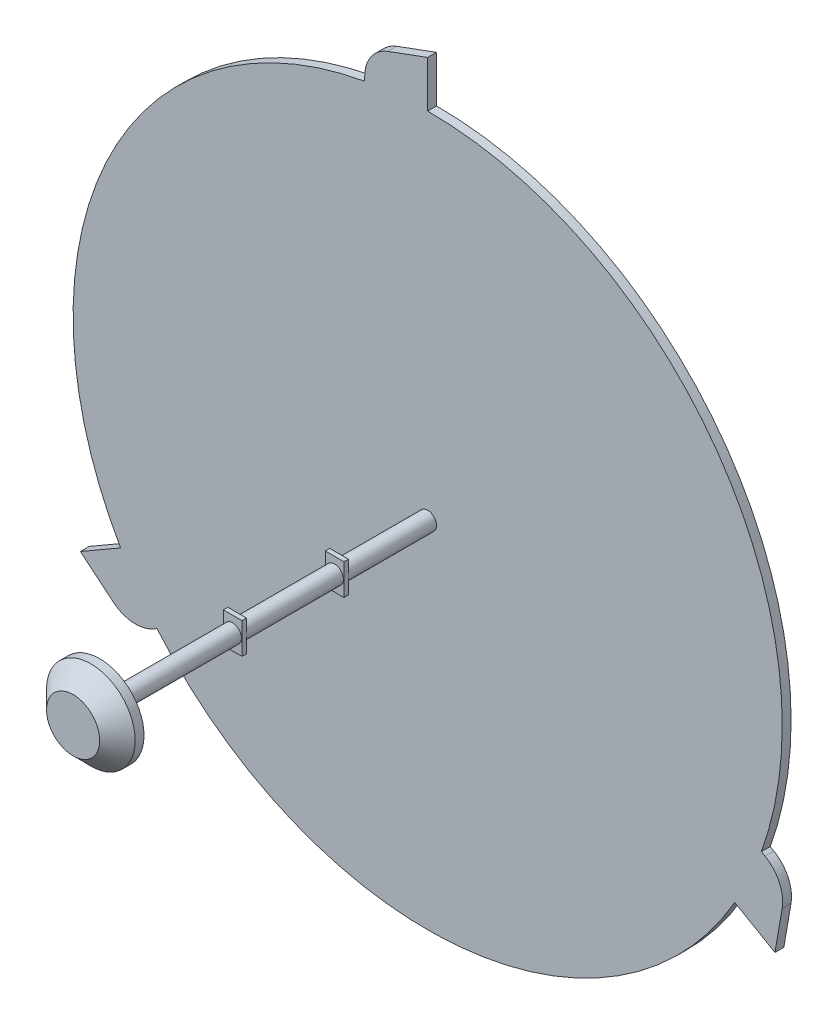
ISO-10303-21;
HEADER;
FILE_DESCRIPTION(('STEP AP214'),'2;1');
FILE_NAME('part.step','',(''),(''),'','','');
FILE_SCHEMA(('AUTOMOTIVE_DESIGN { 1 0 10303 214 1 1 1 1 }'));
ENDSEC;
DATA;
#1=APPLICATION_CONTEXT('core data for automotive mechanical design processes');
#2=APPLICATION_PROTOCOL_DEFINITION('international standard','automotive_design',2000,#1);
#3=PRODUCT_CONTEXT('',#1,'mechanical');
#4=PRODUCT('Part','Part','',(#3));
#5=PRODUCT_RELATED_PRODUCT_CATEGORY('part','',(#4));
#6=PRODUCT_DEFINITION_FORMATION('','',#4);
#7=PRODUCT_DEFINITION_CONTEXT('part definition',#1,'design');
#8=PRODUCT_DEFINITION('design','',#6,#7);
#9=PRODUCT_DEFINITION_SHAPE('','',#8);
#10=(LENGTH_UNIT() NAMED_UNIT(*) SI_UNIT(.MILLI.,.METRE.));
#11=(NAMED_UNIT(*) PLANE_ANGLE_UNIT() SI_UNIT($,.RADIAN.));
#12=(NAMED_UNIT(*) SI_UNIT($,.STERADIAN.) SOLID_ANGLE_UNIT());
#13=UNCERTAINTY_MEASURE_WITH_UNIT(LENGTH_MEASURE(1.E-05),#10,'distance_accuracy_value','');
#14=(GEOMETRIC_REPRESENTATION_CONTEXT(3) GLOBAL_UNCERTAINTY_ASSIGNED_CONTEXT((#13)) GLOBAL_UNIT_ASSIGNED_CONTEXT((#10,
#11,#12)) REPRESENTATION_CONTEXT('',''));
#15=CARTESIAN_POINT('',(0.,0.,0.));
#16=DIRECTION('',(0.,0.,1.));
#17=DIRECTION('',(1.,0.,0.));
#18=AXIS2_PLACEMENT_3D('',#15,#16,#17);
#19=CARTESIAN_POINT('',(0.,0.,-230.));
#20=DIRECTION('',(0.,0.,1.));
#21=DIRECTION('',(1.,0.,0.));
#22=AXIS2_PLACEMENT_3D('',#19,#20,#21);
#23=CYLINDRICAL_SURFACE('',#22,400.);
#24=CARTESIAN_POINT('',(0.,0.,-220.));
#25=DIRECTION('',(0.,0.,-1.));
#26=DIRECTION('',(-1.,0.,0.));
#27=AXIS2_PLACEMENT_3D('',#24,#25,#26);
#28=CIRCLE('',#27,400.);
#29=CARTESIAN_POINT('',(0.,400.,-220.));
#30=VERTEX_POINT('',#29);
#31=CARTESIAN_POINT('',(376.427028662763,-135.287442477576,-220.));
#32=VERTEX_POINT('',#31);
#33=EDGE_CURVE('E210',#30,#32,#28,.T.);
#34=ORIENTED_EDGE('',*,*,#33,.T.);
#35=DIRECTION('',(0.,0.,1.));
#36=VECTOR('',#35,1.);
#37=CARTESIAN_POINT('',(376.427028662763,-135.287442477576,-230.));
#38=LINE('',#37,#36);
#39=CARTESIAN_POINT('',(376.427028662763,-135.287442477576,-230.));
#40=VERTEX_POINT('',#39);
#41=EDGE_CURVE('E347',#40,#32,#38,.T.);
#42=ORIENTED_EDGE('',*,*,#41,.F.);
#43=CARTESIAN_POINT('',(0.,0.,-230.));
#44=DIRECTION('',(0.,0.,-1.));
#45=DIRECTION('',(-1.,0.,0.));
#46=AXIS2_PLACEMENT_3D('',#43,#44,#45);
#47=CIRCLE('',#46,400.);
#48=CARTESIAN_POINT('',(0.,400.,-230.));
#49=VERTEX_POINT('',#48);
#50=EDGE_CURVE('E220',#49,#40,#47,.T.);
#51=ORIENTED_EDGE('',*,*,#50,.F.);
#52=DIRECTION('',(0.,0.,1.));
#53=VECTOR('',#52,1.);
#54=CARTESIAN_POINT('',(0.,400.,-230.));
#55=LINE('',#54,#53);
#56=EDGE_CURVE('E218',#49,#30,#55,.T.);
#57=ORIENTED_EDGE('',*,*,#56,.T.);
#58=EDGE_LOOP('',(#34,#42,#51,#57));
#59=FACE_BOUND('',#58,.T.);
#60=ADVANCED_FACE('F32',(#59),#23,.T.);
#61=CARTESIAN_POINT('',(346.410161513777,-199.999999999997,-230.));
#62=VERTEX_POINT('',#61);
#63=CARTESIAN_POINT('',(-305.375876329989,-258.351648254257,-230.));
#64=VERTEX_POINT('',#63);
#65=EDGE_CURVE('E203',#62,#64,#47,.T.);
#66=ORIENTED_EDGE('',*,*,#65,.F.);
#67=DIRECTION('',(0.,0.,1.));
#68=VECTOR('',#67,1.);
#69=CARTESIAN_POINT('',(346.410161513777,-199.999999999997,-230.));
#70=LINE('',#69,#68);
#71=CARTESIAN_POINT('',(346.410161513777,-199.999999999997,-220.));
#72=VERTEX_POINT('',#71);
#73=EDGE_CURVE('E189',#62,#72,#70,.T.);
#74=ORIENTED_EDGE('',*,*,#73,.T.);
#75=CARTESIAN_POINT('',(-305.375876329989,-258.351648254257,-220.));
#76=VERTEX_POINT('',#75);
#77=EDGE_CURVE('E200',#72,#76,#28,.T.);
#78=ORIENTED_EDGE('',*,*,#77,.T.);
#79=DIRECTION('',(0.,0.,1.));
#80=VECTOR('',#79,1.);
#81=CARTESIAN_POINT('',(-305.375876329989,-258.351648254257,-230.));
#82=LINE('',#81,#80);
#83=EDGE_CURVE('E367',#64,#76,#82,.T.);
#84=ORIENTED_EDGE('',*,*,#83,.F.);
#85=EDGE_LOOP('',(#66,#74,#78,#84));
#86=FACE_BOUND('',#85,.T.);
#87=ADVANCED_FACE('F198',(#86),#23,.T.);
#88=CARTESIAN_POINT('',(10.5,17.5,-120.));
#89=DIRECTION('',(0.,0.,-1.));
#90=DIRECTION('',(-1.,0.,0.));
#91=AXIS2_PLACEMENT_3D('',#88,#89,#90);
#92=PLANE('',#91);
#93=DIRECTION('',(1.,0.,0.));
#94=VECTOR('',#93,1.);
#95=CARTESIAN_POINT('',(-10.5,17.5,-120.));
#96=LINE('',#95,#94);
#97=CARTESIAN_POINT('',(-10.5,17.5,-120.));
#98=VERTEX_POINT('',#97);
#99=CARTESIAN_POINT('',(10.5,17.5,-120.));
#100=VERTEX_POINT('',#99);
#101=EDGE_CURVE('E241',#98,#100,#96,.T.);
#102=ORIENTED_EDGE('',*,*,#101,.T.);
#103=DIRECTION('',(0.,-1.,0.));
#104=VECTOR('',#103,1.);
#105=CARTESIAN_POINT('',(10.5,17.5,-120.));
#106=LINE('',#105,#104);
#107=CARTESIAN_POINT('',(10.5,-17.5,-120.));
#108=VERTEX_POINT('',#107);
#109=EDGE_CURVE('E244',#100,#108,#106,.T.);
#110=ORIENTED_EDGE('',*,*,#109,.T.);
#111=DIRECTION('',(-1.,0.,0.));
#112=VECTOR('',#111,1.);
#113=CARTESIAN_POINT('',(10.5,-17.5,-120.));
#114=LINE('',#113,#112);
#115=CARTESIAN_POINT('',(-10.5,-17.5,-120.));
#116=VERTEX_POINT('',#115);
#117=EDGE_CURVE('E246',#108,#116,#114,.T.);
#118=ORIENTED_EDGE('',*,*,#117,.T.);
#119=DIRECTION('',(0.,1.,0.));
#120=VECTOR('',#119,1.);
#121=CARTESIAN_POINT('',(-10.5,-17.5,-120.));
#122=LINE('',#121,#120);
#123=EDGE_CURVE('E248',#116,#98,#122,.T.);
#124=ORIENTED_EDGE('',*,*,#123,.T.);
#125=EDGE_LOOP('',(#102,#110,#118,#124));
#126=FACE_BOUND('',#125,.T.);
#127=CARTESIAN_POINT('',(0.,0.,-120.));
#128=DIRECTION('',(0.,0.,-1.));
#129=DIRECTION('',(-1.,0.,0.));
#130=AXIS2_PLACEMENT_3D('',#127,#128,#129);
#131=CIRCLE('',#130,10.);
#132=CARTESIAN_POINT('',(-10.,0.,-120.));
#133=VERTEX_POINT('',#132);
#134=EDGE_CURVE('E226',#133,#133,#131,.T.);
#135=ORIENTED_EDGE('',*,*,#134,.F.);
#136=EDGE_LOOP('',(#135));
#137=FACE_BOUND('',#136,.T.);
#138=ADVANCED_FACE('F427',(#126,#137),#92,.T.);
#139=CARTESIAN_POINT('',(10.5,-17.5,-5.));
#140=DIRECTION('',(0.,0.,-1.));
#141=DIRECTION('',(-1.,0.,0.));
#142=AXIS2_PLACEMENT_3D('',#139,#140,#141);
#143=PLANE('',#142);
#144=DIRECTION('',(0.,-1.,0.));
#145=VECTOR('',#144,1.);
#146=CARTESIAN_POINT('',(10.5,17.5,-5.));
#147=LINE('',#146,#145);
#148=CARTESIAN_POINT('',(10.5,17.5,-5.));
#149=VERTEX_POINT('',#148);
#150=CARTESIAN_POINT('',(10.5,-17.5,-5.));
#151=VERTEX_POINT('',#150);
#152=EDGE_CURVE('E277',#149,#151,#147,.T.);
#153=ORIENTED_EDGE('',*,*,#152,.T.);
#154=DIRECTION('',(-1.,0.,0.));
#155=VECTOR('',#154,1.);
#156=CARTESIAN_POINT('',(10.5,-17.5,-5.));
#157=LINE('',#156,#155);
#158=CARTESIAN_POINT('',(-10.5,-17.5,-5.));
#159=VERTEX_POINT('',#158);
#160=EDGE_CURVE('E280',#151,#159,#157,.T.);
#161=ORIENTED_EDGE('',*,*,#160,.T.);
#162=DIRECTION('',(0.,1.,0.));
#163=VECTOR('',#162,1.);
#164=CARTESIAN_POINT('',(-10.5,17.5,-5.));
#165=LINE('',#164,#163);
#166=CARTESIAN_POINT('',(-10.5,17.5,-5.));
#167=VERTEX_POINT('',#166);
#168=EDGE_CURVE('E282',#159,#167,#165,.T.);
#169=ORIENTED_EDGE('',*,*,#168,.T.);
#170=DIRECTION('',(1.,0.,0.));
#171=VECTOR('',#170,1.);
#172=CARTESIAN_POINT('',(10.5,17.5,-5.));
#173=LINE('',#172,#171);
#174=EDGE_CURVE('E284',#167,#149,#173,.T.);
#175=ORIENTED_EDGE('',*,*,#174,.T.);
#176=EDGE_LOOP('',(#153,#161,#169,#175));
#177=FACE_BOUND('',#176,.T.);
#178=CARTESIAN_POINT('',(0.,0.,-5.));
#179=DIRECTION('',(0.,0.,-1.));
#180=DIRECTION('',(-1.,0.,0.));
#181=AXIS2_PLACEMENT_3D('',#178,#179,#180);
#182=CIRCLE('',#181,10.);
#183=CARTESIAN_POINT('',(-10.,0.,-5.));
#184=VERTEX_POINT('',#183);
#185=EDGE_CURVE('E262',#184,#184,#182,.T.);
#186=ORIENTED_EDGE('',*,*,#185,.F.);
#187=EDGE_LOOP('',(#186));
#188=FACE_BOUND('',#187,.T.);
#189=ADVANCED_FACE('F639',(#177,#188),#143,.T.);
#190=CARTESIAN_POINT('',(0.,0.,150.));
#191=DIRECTION('',(0.,0.,-1.));
#192=DIRECTION('',(-1.,0.,0.));
#193=AXIS2_PLACEMENT_3D('',#190,#191,#192);
#194=CYLINDRICAL_SURFACE('',#193,10.);
#195=CARTESIAN_POINT('',(0.,0.,150.));
#196=DIRECTION('',(0.,0.,1.));
#197=DIRECTION('',(1.,0.,0.));
#198=AXIS2_PLACEMENT_3D('',#195,#196,#197);
#199=CIRCLE('',#198,10.);
#200=CARTESIAN_POINT('',(10.,0.,150.));
#201=VERTEX_POINT('',#200);
#202=EDGE_CURVE('E301',#201,#201,#199,.T.);
#203=ORIENTED_EDGE('',*,*,#202,.F.);
#204=EDGE_LOOP('',(#203));
#205=FACE_BOUND('',#204,.T.);
#206=CARTESIAN_POINT('',(0.,0.,0.));
#207=DIRECTION('',(0.,0.,-1.));
#208=DIRECTION('',(-1.,0.,0.));
#209=AXIS2_PLACEMENT_3D('',#206,#207,#208);
#210=CIRCLE('',#209,10.);
#211=CARTESIAN_POINT('',(-10.,0.,0.));
#212=VERTEX_POINT('',#211);
#213=EDGE_CURVE('E298',#212,#212,#210,.T.);
#214=ORIENTED_EDGE('',*,*,#213,.F.);
#215=EDGE_LOOP('',(#214));
#216=FACE_BOUND('',#215,.T.);
#217=ADVANCED_FACE('F34',(#205,#216),#194,.T.);
#218=CARTESIAN_POINT('',(10.5,-17.5,0.));
#219=DIRECTION('',(0.,0.,-1.));
#220=DIRECTION('',(-1.,0.,0.));
#221=AXIS2_PLACEMENT_3D('',#218,#219,#220);
#222=PLANE('',#221);
#223=DIRECTION('',(0.,-1.,0.));
#224=VECTOR('',#223,1.);
#225=CARTESIAN_POINT('',(10.5,17.5,0.));
#226=LINE('',#225,#224);
#227=CARTESIAN_POINT('',(10.5,17.5,0.));
#228=VERTEX_POINT('',#227);
#229=CARTESIAN_POINT('',(10.5,-17.5,0.));
#230=VERTEX_POINT('',#229);
#231=EDGE_CURVE('E268',#228,#230,#226,.T.);
#232=ORIENTED_EDGE('',*,*,#231,.F.);
#233=DIRECTION('',(1.,0.,0.));
#234=VECTOR('',#233,1.);
#235=CARTESIAN_POINT('',(10.5,17.5,0.));
#236=LINE('',#235,#234);
#237=CARTESIAN_POINT('',(-10.5,17.5,0.));
#238=VERTEX_POINT('',#237);
#239=EDGE_CURVE('E275',#238,#228,#236,.T.);
#240=ORIENTED_EDGE('',*,*,#239,.F.);
#241=DIRECTION('',(0.,1.,0.));
#242=VECTOR('',#241,1.);
#243=CARTESIAN_POINT('',(-10.5,17.5,0.));
#244=LINE('',#243,#242);
#245=CARTESIAN_POINT('',(-10.5,-17.5,0.));
#246=VERTEX_POINT('',#245);
#247=EDGE_CURVE('E273',#246,#238,#244,.T.);
#248=ORIENTED_EDGE('',*,*,#247,.F.);
#249=DIRECTION('',(-1.,0.,0.));
#250=VECTOR('',#249,1.);
#251=CARTESIAN_POINT('',(10.5,-17.5,0.));
#252=LINE('',#251,#250);
#253=EDGE_CURVE('E271',#230,#246,#252,.T.);
#254=ORIENTED_EDGE('',*,*,#253,.F.);
#255=EDGE_LOOP('',(#232,#240,#248,#254));
#256=FACE_BOUND('',#255,.T.);
#257=ORIENTED_EDGE('',*,*,#213,.T.);
#258=EDGE_LOOP('',(#257));
#259=FACE_BOUND('',#258,.T.);
#260=ADVANCED_FACE('F748',(#256,#259),#222,.F.);
#261=CARTESIAN_POINT('',(10.5,17.5,-5.));
#262=DIRECTION('',(-1.,0.,0.));
#263=DIRECTION('',(0.,-1.,0.));
#264=AXIS2_PLACEMENT_3D('',#261,#262,#263);
#265=PLANE('',#264);
#266=ORIENTED_EDGE('',*,*,#231,.T.);
#267=DIRECTION('',(0.,0.,1.));
#268=VECTOR('',#267,1.);
#269=CARTESIAN_POINT('',(10.5,-17.5,-5.));
#270=LINE('',#269,#268);
#271=EDGE_CURVE('E295',#151,#230,#270,.T.);
#272=ORIENTED_EDGE('',*,*,#271,.F.);
#273=ORIENTED_EDGE('',*,*,#152,.F.);
#274=DIRECTION('',(0.,0.,1.));
#275=VECTOR('',#274,1.);
#276=CARTESIAN_POINT('',(10.5,17.5,-5.));
#277=LINE('',#276,#275);
#278=EDGE_CURVE('E286',#149,#228,#277,.T.);
#279=ORIENTED_EDGE('',*,*,#278,.T.);
#280=EDGE_LOOP('',(#266,#272,#273,#279));
#281=FACE_BOUND('',#280,.T.);
#282=ADVANCED_FACE('F738',(#281),#265,.F.);
#283=CARTESIAN_POINT('',(10.5,-17.5,-5.));
#284=DIRECTION('',(0.,1.,0.));
#285=DIRECTION('',(-1.,0.,0.));
#286=AXIS2_PLACEMENT_3D('',#283,#284,#285);
#287=PLANE('',#286);
#288=ORIENTED_EDGE('',*,*,#253,.T.);
#289=DIRECTION('',(0.,0.,1.));
#290=VECTOR('',#289,1.);
#291=CARTESIAN_POINT('',(-10.5,-17.5,-5.));
#292=LINE('',#291,#290);
#293=EDGE_CURVE('E292',#159,#246,#292,.T.);
#294=ORIENTED_EDGE('',*,*,#293,.F.);
#295=ORIENTED_EDGE('',*,*,#160,.F.);
#296=ORIENTED_EDGE('',*,*,#271,.T.);
#297=EDGE_LOOP('',(#288,#294,#295,#296));
#298=FACE_BOUND('',#297,.T.);
#299=ADVANCED_FACE('F728',(#298),#287,.F.);
#300=CARTESIAN_POINT('',(-10.5,17.5,-5.));
#301=DIRECTION('',(1.,0.,0.));
#302=DIRECTION('',(0.,1.,0.));
#303=AXIS2_PLACEMENT_3D('',#300,#301,#302);
#304=PLANE('',#303);
#305=ORIENTED_EDGE('',*,*,#247,.T.);
#306=DIRECTION('',(0.,0.,1.));
#307=VECTOR('',#306,1.);
#308=CARTESIAN_POINT('',(-10.5,17.5,-5.));
#309=LINE('',#308,#307);
#310=EDGE_CURVE('E289',#167,#238,#309,.T.);
#311=ORIENTED_EDGE('',*,*,#310,.F.);
#312=ORIENTED_EDGE('',*,*,#168,.F.);
#313=ORIENTED_EDGE('',*,*,#293,.T.);
#314=EDGE_LOOP('',(#305,#311,#312,#313));
#315=FACE_BOUND('',#314,.T.);
#316=ADVANCED_FACE('F718',(#315),#304,.F.);
#317=CARTESIAN_POINT('',(10.5,17.5,-5.));
#318=DIRECTION('',(0.,-1.,0.));
#319=DIRECTION('',(1.,0.,0.));
#320=AXIS2_PLACEMENT_3D('',#317,#318,#319);
#321=PLANE('',#320);
#322=ORIENTED_EDGE('',*,*,#239,.T.);
#323=ORIENTED_EDGE('',*,*,#278,.F.);
#324=ORIENTED_EDGE('',*,*,#174,.F.);
#325=ORIENTED_EDGE('',*,*,#310,.T.);
#326=EDGE_LOOP('',(#322,#323,#324,#325));
#327=FACE_BOUND('',#326,.T.);
#328=ADVANCED_FACE('F699',(#327),#321,.F.);
#329=CARTESIAN_POINT('',(0.,0.,-115.));
#330=DIRECTION('',(0.,0.,1.));
#331=DIRECTION('',(1.,0.,0.));
#332=AXIS2_PLACEMENT_3D('',#329,#330,#331);
#333=CYLINDRICAL_SURFACE('',#332,10.);
#334=CARTESIAN_POINT('',(0.,0.,-115.));
#335=DIRECTION('',(0.,0.,-1.));
#336=DIRECTION('',(-1.,0.,0.));
#337=AXIS2_PLACEMENT_3D('',#334,#335,#336);
#338=CIRCLE('',#337,10.);
#339=CARTESIAN_POINT('',(-10.,0.,-115.));
#340=VERTEX_POINT('',#339);
#341=EDGE_CURVE('E265',#340,#340,#338,.T.);
#342=ORIENTED_EDGE('',*,*,#341,.F.);
#343=EDGE_LOOP('',(#342));
#344=FACE_BOUND('',#343,.T.);
#345=ORIENTED_EDGE('',*,*,#185,.T.);
#346=EDGE_LOOP('',(#345));
#347=FACE_BOUND('',#346,.T.);
#348=ADVANCED_FACE('F689',(#344,#347),#333,.T.);
#349=CARTESIAN_POINT('',(10.5,17.5,-115.));
#350=DIRECTION('',(0.,0.,-1.));
#351=DIRECTION('',(-1.,0.,0.));
#352=AXIS2_PLACEMENT_3D('',#349,#350,#351);
#353=PLANE('',#352);
#354=DIRECTION('',(1.,0.,0.));
#355=VECTOR('',#354,1.);
#356=CARTESIAN_POINT('',(-10.5,17.5,-115.));
#357=LINE('',#356,#355);
#358=CARTESIAN_POINT('',(-10.5,17.5,-115.));
#359=VERTEX_POINT('',#358);
#360=CARTESIAN_POINT('',(10.5,17.5,-115.));
#361=VERTEX_POINT('',#360);
#362=EDGE_CURVE('E232',#359,#361,#357,.T.);
#363=ORIENTED_EDGE('',*,*,#362,.F.);
#364=DIRECTION('',(0.,1.,0.));
#365=VECTOR('',#364,1.);
#366=CARTESIAN_POINT('',(-10.5,-17.5,-115.));
#367=LINE('',#366,#365);
#368=CARTESIAN_POINT('',(-10.5,-17.5,-115.));
#369=VERTEX_POINT('',#368);
#370=EDGE_CURVE('E239',#369,#359,#367,.T.);
#371=ORIENTED_EDGE('',*,*,#370,.F.);
#372=DIRECTION('',(-1.,0.,0.));
#373=VECTOR('',#372,1.);
#374=CARTESIAN_POINT('',(10.5,-17.5,-115.));
#375=LINE('',#374,#373);
#376=CARTESIAN_POINT('',(10.5,-17.5,-115.));
#377=VERTEX_POINT('',#376);
#378=EDGE_CURVE('E237',#377,#369,#375,.T.);
#379=ORIENTED_EDGE('',*,*,#378,.F.);
#380=DIRECTION('',(0.,-1.,0.));
#381=VECTOR('',#380,1.);
#382=CARTESIAN_POINT('',(10.5,17.5,-115.));
#383=LINE('',#382,#381);
#384=EDGE_CURVE('E235',#361,#377,#383,.T.);
#385=ORIENTED_EDGE('',*,*,#384,.F.);
#386=EDGE_LOOP('',(#363,#371,#379,#385));
#387=FACE_BOUND('',#386,.T.);
#388=ORIENTED_EDGE('',*,*,#341,.T.);
#389=EDGE_LOOP('',(#388));
#390=FACE_BOUND('',#389,.T.);
#391=ADVANCED_FACE('F679',(#387,#390),#353,.F.);
#392=CARTESIAN_POINT('',(-10.5,17.5,-120.));
#393=DIRECTION('',(0.,-1.,0.));
#394=DIRECTION('',(1.,0.,0.));
#395=AXIS2_PLACEMENT_3D('',#392,#393,#394);
#396=PLANE('',#395);
#397=ORIENTED_EDGE('',*,*,#362,.T.);
#398=DIRECTION('',(0.,0.,1.));
#399=VECTOR('',#398,1.);
#400=CARTESIAN_POINT('',(10.5,17.5,-120.));
#401=LINE('',#400,#399);
#402=EDGE_CURVE('E259',#100,#361,#401,.T.);
#403=ORIENTED_EDGE('',*,*,#402,.F.);
#404=ORIENTED_EDGE('',*,*,#101,.F.);
#405=DIRECTION('',(0.,0.,1.));
#406=VECTOR('',#405,1.);
#407=CARTESIAN_POINT('',(-10.5,17.5,-120.));
#408=LINE('',#407,#406);
#409=EDGE_CURVE('E250',#98,#359,#408,.T.);
#410=ORIENTED_EDGE('',*,*,#409,.T.);
#411=EDGE_LOOP('',(#397,#403,#404,#410));
#412=FACE_BOUND('',#411,.T.);
#413=ADVANCED_FACE('F669',(#412),#396,.F.);
#414=CARTESIAN_POINT('',(10.5,17.5,-120.));
#415=DIRECTION('',(-1.,0.,0.));
#416=DIRECTION('',(0.,-1.,0.));
#417=AXIS2_PLACEMENT_3D('',#414,#415,#416);
#418=PLANE('',#417);
#419=ORIENTED_EDGE('',*,*,#384,.T.);
#420=DIRECTION('',(0.,0.,1.));
#421=VECTOR('',#420,1.);
#422=CARTESIAN_POINT('',(10.5,-17.5,-120.));
#423=LINE('',#422,#421);
#424=EDGE_CURVE('E256',#108,#377,#423,.T.);
#425=ORIENTED_EDGE('',*,*,#424,.F.);
#426=ORIENTED_EDGE('',*,*,#109,.F.);
#427=ORIENTED_EDGE('',*,*,#402,.T.);
#428=EDGE_LOOP('',(#419,#425,#426,#427));
#429=FACE_BOUND('',#428,.T.);
#430=ADVANCED_FACE('F659',(#429),#418,.F.);
#431=CARTESIAN_POINT('',(10.5,-17.5,-120.));
#432=DIRECTION('',(0.,1.,0.));
#433=DIRECTION('',(-1.,0.,0.));
#434=AXIS2_PLACEMENT_3D('',#431,#432,#433);
#435=PLANE('',#434);
#436=ORIENTED_EDGE('',*,*,#378,.T.);
#437=DIRECTION('',(0.,0.,1.));
#438=VECTOR('',#437,1.);
#439=CARTESIAN_POINT('',(-10.5,-17.5,-120.));
#440=LINE('',#439,#438);
#441=EDGE_CURVE('E253',#116,#369,#440,.T.);
#442=ORIENTED_EDGE('',*,*,#441,.F.);
#443=ORIENTED_EDGE('',*,*,#117,.F.);
#444=ORIENTED_EDGE('',*,*,#424,.T.);
#445=EDGE_LOOP('',(#436,#442,#443,#444));
#446=FACE_BOUND('',#445,.T.);
#447=ADVANCED_FACE('F649',(#446),#435,.F.);
#448=CARTESIAN_POINT('',(-10.5,-17.5,-120.));
#449=DIRECTION('',(1.,0.,0.));
#450=DIRECTION('',(0.,1.,0.));
#451=AXIS2_PLACEMENT_3D('',#448,#449,#450);
#452=PLANE('',#451);
#453=ORIENTED_EDGE('',*,*,#370,.T.);
#454=ORIENTED_EDGE('',*,*,#409,.F.);
#455=ORIENTED_EDGE('',*,*,#123,.F.);
#456=ORIENTED_EDGE('',*,*,#441,.T.);
#457=EDGE_LOOP('',(#453,#454,#455,#456));
#458=FACE_BOUND('',#457,.T.);
#459=ADVANCED_FACE('F629',(#458),#452,.F.);
#460=CARTESIAN_POINT('',(0.,0.,-220.));
#461=DIRECTION('',(0.,0.,1.));
#462=DIRECTION('',(1.,0.,0.));
#463=AXIS2_PLACEMENT_3D('',#460,#461,#462);
#464=CYLINDRICAL_SURFACE('',#463,10.);
#465=CARTESIAN_POINT('',(0.,0.,-220.));
#466=DIRECTION('',(0.,0.,-1.));
#467=DIRECTION('',(-1.,0.,0.));
#468=AXIS2_PLACEMENT_3D('',#465,#466,#467);
#469=CIRCLE('',#468,10.);
#470=CARTESIAN_POINT('',(-10.,0.,-220.));
#471=VERTEX_POINT('',#470);
#472=EDGE_CURVE('E229',#471,#471,#469,.T.);
#473=ORIENTED_EDGE('',*,*,#472,.F.);
#474=EDGE_LOOP('',(#473));
#475=FACE_BOUND('',#474,.T.);
#476=ORIENTED_EDGE('',*,*,#134,.T.);
#477=EDGE_LOOP('',(#476));
#478=FACE_BOUND('',#477,.T.);
#479=ADVANCED_FACE('F619',(#475,#478),#464,.T.);
#480=CARTESIAN_POINT('',(0.,0.,150.));
#481=DIRECTION('',(0.,0.,1.));
#482=DIRECTION('',(1.,0.,0.));
#483=AXIS2_PLACEMENT_3D('',#480,#481,#482);
#484=PLANE('',#483);
#485=CARTESIAN_POINT('',(0.,0.,150.));
#486=DIRECTION('',(0.,0.,1.));
#487=DIRECTION('',(1.,0.,0.));
#488=AXIS2_PLACEMENT_3D('',#485,#486,#487);
#489=CIRCLE('',#488,50.);
#490=CARTESIAN_POINT('',(50.,0.,150.));
#491=VERTEX_POINT('',#490);
#492=EDGE_CURVE('E223',#491,#491,#489,.T.);
#493=ORIENTED_EDGE('',*,*,#492,.F.);
#494=EDGE_LOOP('',(#493));
#495=FACE_BOUND('',#494,.T.);
#496=ORIENTED_EDGE('',*,*,#202,.T.);
#497=EDGE_LOOP('',(#496));
#498=FACE_BOUND('',#497,.T.);
#499=ADVANCED_FACE('F609',(#495,#498),#484,.F.);
#500=CARTESIAN_POINT('',(0.,0.,180.));
#501=DIRECTION('',(0.,0.,-1.));
#502=DIRECTION('',(-1.,0.,0.));
#503=AXIS2_PLACEMENT_3D('',#500,#501,#502);
#504=CYLINDRICAL_SURFACE('',#503,50.);
#505=CARTESIAN_POINT('',(0.,0.,160.));
#506=DIRECTION('',(0.,0.,1.));
#507=DIRECTION('',(1.,0.,0.));
#508=AXIS2_PLACEMENT_3D('',#505,#506,#507);
#509=CIRCLE('',#508,50.);
#510=CARTESIAN_POINT('',(50.,0.,160.));
#511=VERTEX_POINT('',#510);
#512=EDGE_CURVE('E307',#511,#511,#509,.F.);
#513=ORIENTED_EDGE('',*,*,#512,.T.);
#514=EDGE_LOOP('',(#513));
#515=FACE_BOUND('',#514,.T.);
#516=ORIENTED_EDGE('',*,*,#492,.T.);
#517=EDGE_LOOP('',(#516));
#518=FACE_BOUND('',#517,.T.);
#519=ADVANCED_FACE('F599',(#515,#518),#504,.T.);
#520=CARTESIAN_POINT('',(0.,0.,180.));
#521=DIRECTION('',(0.,0.,1.));
#522=DIRECTION('',(1.,0.,0.));
#523=AXIS2_PLACEMENT_3D('',#520,#521,#522);
#524=PLANE('',#523);
#525=CARTESIAN_POINT('',(0.,0.,180.));
#526=DIRECTION('',(0.,0.,1.));
#527=DIRECTION('',(1.,0.,0.));
#528=AXIS2_PLACEMENT_3D('',#525,#526,#527);
#529=CIRCLE('',#528,30.);
#530=CARTESIAN_POINT('',(30.,0.,180.));
#531=VERTEX_POINT('',#530);
#532=EDGE_CURVE('E304',#531,#531,#529,.T.);
#533=ORIENTED_EDGE('',*,*,#532,.T.);
#534=EDGE_LOOP('',(#533));
#535=FACE_BOUND('',#534,.T.);
#536=ADVANCED_FACE('F590',(#535),#524,.T.);
#537=CARTESIAN_POINT('',(0.,0.,180.));
#538=DIRECTION('',(0.,0.,-1.));
#539=DIRECTION('',(-1.,0.,0.));
#540=AXIS2_PLACEMENT_3D('',#537,#538,#539);
#541=CONICAL_SURFACE('',#540,30.,0.785398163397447);
#542=ORIENTED_EDGE('',*,*,#512,.F.);
#543=EDGE_LOOP('',(#542));
#544=FACE_BOUND('',#543,.T.);
#545=ORIENTED_EDGE('',*,*,#532,.F.);
#546=EDGE_LOOP('',(#545));
#547=FACE_BOUND('',#546,.T.);
#548=ADVANCED_FACE('F436',(#544,#547),#541,.T.);
#549=CARTESIAN_POINT('',(0.,0.,-220.));
#550=DIRECTION('',(0.,0.,-1.));
#551=DIRECTION('',(-1.,0.,0.));
#552=AXIS2_PLACEMENT_3D('',#549,#550,#551);
#553=PLANE('',#552);
#554=DIRECTION('',(0.169565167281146,0.985518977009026,0.));
#555=VECTOR('',#554,1.);
#556=CARTESIAN_POINT('',(391.780351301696,-226.194491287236,-220.));
#557=LINE('',#556,#555);
#558=CARTESIAN_POINT('',(391.780351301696,-226.194491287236,-220.));
#559=VERTEX_POINT('',#558);
#560=CARTESIAN_POINT('',(399.892516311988,-179.046290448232,-220.));
#561=VERTEX_POINT('',#560);
#562=EDGE_CURVE('E194',#559,#561,#557,.T.);
#563=ORIENTED_EDGE('',*,*,#562,.T.);
#564=CARTESIAN_POINT('',(360.471757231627,-172.263683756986,-220.));
#565=DIRECTION('',(0.,0.,-1.));
#566=DIRECTION('',(-1.,0.,0.));
#567=AXIS2_PLACEMENT_3D('',#564,#565,#566);
#568=CIRCLE('',#567,40.);
#569=CARTESIAN_POINT('',(380.471757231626,-137.622667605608,-220.));
#570=VERTEX_POINT('',#569);
#571=EDGE_CURVE('E54',#561,#570,#568,.F.);
#572=ORIENTED_EDGE('',*,*,#571,.T.);
#573=DIRECTION('',(-0.866025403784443,0.499999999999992,0.));
#574=VECTOR('',#573,1.);
#575=CARTESIAN_POINT('',(404.620832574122,-151.565142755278,-220.));
#576=LINE('',#575,#574);
#577=EDGE_CURVE('E339',#570,#32,#576,.T.);
#578=ORIENTED_EDGE('',*,*,#577,.T.);
#579=ORIENTED_EDGE('',*,*,#33,.F.);
#580=DIRECTION('',(0.,1.,0.));
#581=VECTOR('',#580,1.);
#582=CARTESIAN_POINT('',(0.,400.,-220.));
#583=LINE('',#582,#581);
#584=CARTESIAN_POINT('',(0.,452.388982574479,-220.));
#585=VERTEX_POINT('',#584);
#586=EDGE_CURVE('E369',#30,#585,#583,.T.);
#587=ORIENTED_EDGE('',*,*,#586,.T.);
#588=DIRECTION('',(-0.938267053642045,-0.345911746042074,0.));
#589=VECTOR('',#588,1.);
#590=CARTESIAN_POINT('',(0.,452.388982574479,-220.));
#591=LINE('',#590,#589);
#592=CARTESIAN_POINT('',(-44.8876221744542,435.840223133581,-220.));
#593=VERTEX_POINT('',#592);
#594=EDGE_CURVE('E376',#585,#593,#591,.T.);
#595=ORIENTED_EDGE('',*,*,#594,.T.);
#596=CARTESIAN_POINT('',(-31.0511523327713,398.309540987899,-220.));
#597=DIRECTION('',(0.,0.,-1.));
#598=DIRECTION('',(-1.,0.,0.));
#599=AXIS2_PLACEMENT_3D('',#596,#597,#598);
#600=CIRCLE('',#599,40.);
#601=CARTESIAN_POINT('',(-71.0511523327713,398.309540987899,-220.));
#602=VERTEX_POINT('',#601);
#603=EDGE_CURVE('E313',#593,#602,#600,.F.);
#604=ORIENTED_EDGE('',*,*,#603,.T.);
#605=DIRECTION('',(0.,-1.,0.));
#606=VECTOR('',#605,1.);
#607=CARTESIAN_POINT('',(-71.0511523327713,426.194491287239,-220.));
#608=LINE('',#607,#606);
#609=CARTESIAN_POINT('',(-71.0511523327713,393.639090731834,-220.));
#610=VERTEX_POINT('',#609);
#611=EDGE_CURVE('E379',#602,#610,#608,.T.);
#612=ORIENTED_EDGE('',*,*,#611,.T.);
#613=CARTESIAN_POINT('',(-346.410161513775,-200.000000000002,-220.));
#614=VERTEX_POINT('',#613);
#615=EDGE_CURVE('E211',#614,#610,#28,.T.);
#616=ORIENTED_EDGE('',*,*,#615,.F.);
#617=DIRECTION('',(-0.866025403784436,-0.500000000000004,0.));
#618=VECTOR('',#617,1.);
#619=CARTESIAN_POINT('',(-346.410161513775,-200.000000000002,-220.));
#620=LINE('',#619,#618);
#621=CARTESIAN_POINT('',(-391.780351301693,-226.194491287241,-220.));
#622=VERTEX_POINT('',#621);
#623=EDGE_CURVE('E350',#614,#622,#620,.T.);
#624=ORIENTED_EDGE('',*,*,#623,.T.);
#625=DIRECTION('',(0.768701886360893,-0.639607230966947,0.));
#626=VECTOR('',#625,1.);
#627=CARTESIAN_POINT('',(-391.780351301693,-226.194491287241,-220.));
#628=LINE('',#627,#626);
#629=CARTESIAN_POINT('',(-355.004894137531,-256.793932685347,-220.));
#630=VERTEX_POINT('',#629);
#631=EDGE_CURVE('E354',#622,#630,#628,.T.);
#632=ORIENTED_EDGE('',*,*,#631,.T.);
#633=CARTESIAN_POINT('',(-329.420604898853,-226.045857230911,-220.));
#634=DIRECTION('',(0.,0.,-1.));
#635=DIRECTION('',(-1.,0.,0.));
#636=AXIS2_PLACEMENT_3D('',#633,#634,#635);
#637=CIRCLE('',#636,40.);
#638=CARTESIAN_POINT('',(-309.420604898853,-260.686873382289,-220.));
#639=VERTEX_POINT('',#638);
#640=EDGE_CURVE('E322',#630,#639,#637,.F.);
#641=ORIENTED_EDGE('',*,*,#640,.T.);
#642=DIRECTION('',(0.866025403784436,0.500000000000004,0.));
#643=VECTOR('',#642,1.);
#644=CARTESIAN_POINT('',(-333.569680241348,-274.629348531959,-220.));
#645=LINE('',#644,#643);
#646=EDGE_CURVE('E209',#639,#76,#645,.T.);
#647=ORIENTED_EDGE('',*,*,#646,.T.);
#648=ORIENTED_EDGE('',*,*,#77,.F.);
#649=DIRECTION('',(0.866025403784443,-0.499999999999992,0.));
#650=VECTOR('',#649,1.);
#651=CARTESIAN_POINT('',(346.410161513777,-199.999999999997,-220.));
#652=LINE('',#651,#650);
#653=EDGE_CURVE('E185',#72,#559,#652,.T.);
#654=ORIENTED_EDGE('',*,*,#653,.T.);
#655=EDGE_LOOP('',(#563,#572,#578,#579,#587,#595,#604,#612,#616,#624,#632,#641,#647,#648,#654));
#656=FACE_BOUND('',#655,.T.);
#657=ORIENTED_EDGE('',*,*,#472,.T.);
#658=EDGE_LOOP('',(#657));
#659=FACE_BOUND('',#658,.T.);
#660=ADVANCED_FACE('F206',(#656,#659),#553,.F.);
#661=CARTESIAN_POINT('',(-346.410161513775,-200.000000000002,-230.));
#662=VERTEX_POINT('',#661);
#663=CARTESIAN_POINT('',(-71.0511523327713,393.639090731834,-230.));
#664=VERTEX_POINT('',#663);
#665=EDGE_CURVE('E214',#662,#664,#47,.T.);
#666=ORIENTED_EDGE('',*,*,#665,.F.);
#667=DIRECTION('',(0.,0.,1.));
#668=VECTOR('',#667,1.);
#669=CARTESIAN_POINT('',(-346.410161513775,-200.000000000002,-230.));
#670=LINE('',#669,#668);
#671=EDGE_CURVE('E366',#662,#614,#670,.T.);
#672=ORIENTED_EDGE('',*,*,#671,.T.);
#673=ORIENTED_EDGE('',*,*,#615,.T.);
#674=DIRECTION('',(0.,0.,1.));
#675=VECTOR('',#674,1.);
#676=CARTESIAN_POINT('',(-71.0511523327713,393.639090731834,-230.));
#677=LINE('',#676,#675);
#678=EDGE_CURVE('E215',#664,#610,#677,.T.);
#679=ORIENTED_EDGE('',*,*,#678,.F.);
#680=EDGE_LOOP('',(#666,#672,#673,#679));
#681=FACE_BOUND('',#680,.T.);
#682=ADVANCED_FACE('F423',(#681),#23,.T.);
#683=CARTESIAN_POINT('',(0.,0.,-230.));
#684=DIRECTION('',(0.,0.,-1.));
#685=DIRECTION('',(-1.,0.,0.));
#686=AXIS2_PLACEMENT_3D('',#683,#684,#685);
#687=PLANE('',#686);
#688=DIRECTION('',(-0.866025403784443,0.499999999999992,0.));
#689=VECTOR('',#688,1.);
#690=CARTESIAN_POINT('',(404.620832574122,-151.565142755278,-230.));
#691=LINE('',#690,#689);
#692=CARTESIAN_POINT('',(380.471757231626,-137.622667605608,-230.));
#693=VERTEX_POINT('',#692);
#694=EDGE_CURVE('E204',#693,#40,#691,.T.);
#695=ORIENTED_EDGE('',*,*,#694,.F.);
#696=CARTESIAN_POINT('',(360.471757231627,-172.263683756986,-230.));
#697=DIRECTION('',(0.,0.,-1.));
#698=DIRECTION('',(-1.,0.,0.));
#699=AXIS2_PLACEMENT_3D('',#696,#697,#698);
#700=CIRCLE('',#699,40.);
#701=CARTESIAN_POINT('',(399.892516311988,-179.046290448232,-230.));
#702=VERTEX_POINT('',#701);
#703=EDGE_CURVE('E11',#693,#702,#700,.T.);
#704=ORIENTED_EDGE('',*,*,#703,.T.);
#705=DIRECTION('',(0.169565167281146,0.985518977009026,0.));
#706=VECTOR('',#705,1.);
#707=CARTESIAN_POINT('',(391.780351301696,-226.194491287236,-230.));
#708=LINE('',#707,#706);
#709=CARTESIAN_POINT('',(391.780351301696,-226.194491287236,-230.));
#710=VERTEX_POINT('',#709);
#711=EDGE_CURVE('E336',#710,#702,#708,.T.);
#712=ORIENTED_EDGE('',*,*,#711,.F.);
#713=DIRECTION('',(0.866025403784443,-0.499999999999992,0.));
#714=VECTOR('',#713,1.);
#715=CARTESIAN_POINT('',(346.410161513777,-199.999999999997,-230.));
#716=LINE('',#715,#714);
#717=EDGE_CURVE('E341',#62,#710,#716,.T.);
#718=ORIENTED_EDGE('',*,*,#717,.F.);
#719=ORIENTED_EDGE('',*,*,#65,.T.);
#720=DIRECTION('',(0.866025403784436,0.500000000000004,0.));
#721=VECTOR('',#720,1.);
#722=CARTESIAN_POINT('',(-333.569680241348,-274.629348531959,-230.));
#723=LINE('',#722,#721);
#724=CARTESIAN_POINT('',(-309.420604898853,-260.686873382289,-230.));
#725=VERTEX_POINT('',#724);
#726=EDGE_CURVE('E364',#725,#64,#723,.T.);
#727=ORIENTED_EDGE('',*,*,#726,.F.);
#728=CARTESIAN_POINT('',(-329.420604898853,-226.045857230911,-230.));
#729=DIRECTION('',(0.,0.,-1.));
#730=DIRECTION('',(-1.,0.,0.));
#731=AXIS2_PLACEMENT_3D('',#728,#729,#730);
#732=CIRCLE('',#731,40.);
#733=CARTESIAN_POINT('',(-355.004894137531,-256.793932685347,-230.));
#734=VERTEX_POINT('',#733);
#735=EDGE_CURVE('E326',#725,#734,#732,.T.);
#736=ORIENTED_EDGE('',*,*,#735,.T.);
#737=DIRECTION('',(0.768701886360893,-0.639607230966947,0.));
#738=VECTOR('',#737,1.);
#739=CARTESIAN_POINT('',(-391.780351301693,-226.194491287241,-230.));
#740=LINE('',#739,#738);
#741=CARTESIAN_POINT('',(-391.780351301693,-226.194491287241,-230.));
#742=VERTEX_POINT('',#741);
#743=EDGE_CURVE('E361',#742,#734,#740,.T.);
#744=ORIENTED_EDGE('',*,*,#743,.F.);
#745=DIRECTION('',(-0.866025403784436,-0.500000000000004,0.));
#746=VECTOR('',#745,1.);
#747=CARTESIAN_POINT('',(-346.410161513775,-200.000000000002,-230.));
#748=LINE('',#747,#746);
#749=EDGE_CURVE('E358',#662,#742,#748,.T.);
#750=ORIENTED_EDGE('',*,*,#749,.F.);
#751=ORIENTED_EDGE('',*,*,#665,.T.);
#752=DIRECTION('',(0.,-1.,0.));
#753=VECTOR('',#752,1.);
#754=CARTESIAN_POINT('',(-71.0511523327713,426.194491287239,-230.));
#755=LINE('',#754,#753);
#756=CARTESIAN_POINT('',(-71.0511523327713,398.309540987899,-230.));
#757=VERTEX_POINT('',#756);
#758=EDGE_CURVE('E388',#757,#664,#755,.T.);
#759=ORIENTED_EDGE('',*,*,#758,.F.);
#760=CARTESIAN_POINT('',(-31.0511523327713,398.309540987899,-230.));
#761=DIRECTION('',(0.,0.,-1.));
#762=DIRECTION('',(-1.,0.,0.));
#763=AXIS2_PLACEMENT_3D('',#760,#761,#762);
#764=CIRCLE('',#763,40.);
#765=CARTESIAN_POINT('',(-44.8876221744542,435.840223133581,-230.));
#766=VERTEX_POINT('',#765);
#767=EDGE_CURVE('E317',#757,#766,#764,.T.);
#768=ORIENTED_EDGE('',*,*,#767,.T.);
#769=DIRECTION('',(-0.938267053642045,-0.345911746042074,0.));
#770=VECTOR('',#769,1.);
#771=CARTESIAN_POINT('',(0.,452.388982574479,-230.));
#772=LINE('',#771,#770);
#773=CARTESIAN_POINT('',(0.,452.388982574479,-230.));
#774=VERTEX_POINT('',#773);
#775=EDGE_CURVE('E385',#774,#766,#772,.T.);
#776=ORIENTED_EDGE('',*,*,#775,.F.);
#777=DIRECTION('',(0.,1.,0.));
#778=VECTOR('',#777,1.);
#779=CARTESIAN_POINT('',(0.,400.,-230.));
#780=LINE('',#779,#778);
#781=EDGE_CURVE('E382',#49,#774,#780,.T.);
#782=ORIENTED_EDGE('',*,*,#781,.F.);
#783=ORIENTED_EDGE('',*,*,#50,.T.);
#784=EDGE_LOOP('',(#695,#704,#712,#718,#719,#727,#736,#744,#750,#751,#759,#768,#776,#782,#783));
#785=FACE_BOUND('',#784,.T.);
#786=ADVANCED_FACE('F403',(#785),#687,.T.);
#787=CARTESIAN_POINT('',(-71.0511523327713,426.194491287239,-230.));
#788=DIRECTION('',(-1.,0.,0.));
#789=DIRECTION('',(0.,0.,1.));
#790=AXIS2_PLACEMENT_3D('',#787,#788,#789);
#791=PLANE('',#790);
#792=ORIENTED_EDGE('',*,*,#611,.F.);
#793=DIRECTION('',(0.,0.,1.));
#794=VECTOR('',#793,1.);
#795=CARTESIAN_POINT('',(-71.0511523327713,398.309540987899,-230.));
#796=LINE('',#795,#794);
#797=EDGE_CURVE('E315',#602,#757,#796,.F.);
#798=ORIENTED_EDGE('',*,*,#797,.T.);
#799=ORIENTED_EDGE('',*,*,#758,.T.);
#800=ORIENTED_EDGE('',*,*,#678,.T.);
#801=EDGE_LOOP('',(#792,#798,#799,#800));
#802=FACE_BOUND('',#801,.T.);
#803=ADVANCED_FACE('F417',(#802),#791,.T.);
#804=CARTESIAN_POINT('',(0.,452.388982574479,-230.));
#805=DIRECTION('',(-0.345911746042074,0.938267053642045,0.));
#806=DIRECTION('',(-0.938267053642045,-0.345911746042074,0.));
#807=AXIS2_PLACEMENT_3D('',#804,#805,#806);
#808=PLANE('',#807);
#809=ORIENTED_EDGE('',*,*,#775,.T.);
#810=DIRECTION('',(0.,0.,1.));
#811=VECTOR('',#810,1.);
#812=CARTESIAN_POINT('',(-44.8876221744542,435.840223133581,-230.));
#813=LINE('',#812,#811);
#814=EDGE_CURVE('E310',#766,#593,#813,.T.);
#815=ORIENTED_EDGE('',*,*,#814,.T.);
#816=ORIENTED_EDGE('',*,*,#594,.F.);
#817=DIRECTION('',(0.,0.,1.));
#818=VECTOR('',#817,1.);
#819=CARTESIAN_POINT('',(0.,452.388982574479,-230.));
#820=LINE('',#819,#818);
#821=EDGE_CURVE('E392',#774,#585,#820,.T.);
#822=ORIENTED_EDGE('',*,*,#821,.F.);
#823=EDGE_LOOP('',(#809,#815,#816,#822));
#824=FACE_BOUND('',#823,.T.);
#825=ADVANCED_FACE('F408',(#824),#808,.T.);
#826=CARTESIAN_POINT('',(0.,400.,-230.));
#827=DIRECTION('',(1.,0.,0.));
#828=DIRECTION('',(0.,0.,-1.));
#829=AXIS2_PLACEMENT_3D('',#826,#827,#828);
#830=PLANE('',#829);
#831=ORIENTED_EDGE('',*,*,#586,.F.);
#832=ORIENTED_EDGE('',*,*,#56,.F.);
#833=ORIENTED_EDGE('',*,*,#781,.T.);
#834=ORIENTED_EDGE('',*,*,#821,.T.);
#835=EDGE_LOOP('',(#831,#832,#833,#834));
#836=FACE_BOUND('',#835,.T.);
#837=ADVANCED_FACE('F405',(#836),#830,.T.);
#838=CARTESIAN_POINT('',(-31.0511523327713,398.309540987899,-230.));
#839=DIRECTION('',(0.,0.,1.));
#840=DIRECTION('',(1.,0.,0.));
#841=AXIS2_PLACEMENT_3D('',#838,#839,#840);
#842=CYLINDRICAL_SURFACE('',#841,40.);
#843=ORIENTED_EDGE('',*,*,#767,.F.);
#844=ORIENTED_EDGE('',*,*,#797,.F.);
#845=ORIENTED_EDGE('',*,*,#603,.F.);
#846=ORIENTED_EDGE('',*,*,#814,.F.);
#847=EDGE_LOOP('',(#843,#844,#845,#846));
#848=FACE_BOUND('',#847,.T.);
#849=ADVANCED_FACE('F407',(#848),#842,.T.);
#850=CARTESIAN_POINT('',(-333.569680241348,-274.629348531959,-230.));
#851=DIRECTION('',(0.500000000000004,-0.866025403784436,0.));
#852=DIRECTION('',(0.866025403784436,0.500000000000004,0.));
#853=AXIS2_PLACEMENT_3D('',#850,#851,#852);
#854=PLANE('',#853);
#855=ORIENTED_EDGE('',*,*,#646,.F.);
#856=DIRECTION('',(0.,0.,1.));
#857=VECTOR('',#856,1.);
#858=CARTESIAN_POINT('',(-309.420604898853,-260.686873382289,-230.));
#859=LINE('',#858,#857);
#860=EDGE_CURVE('E324',#639,#725,#859,.F.);
#861=ORIENTED_EDGE('',*,*,#860,.T.);
#862=ORIENTED_EDGE('',*,*,#726,.T.);
#863=ORIENTED_EDGE('',*,*,#83,.T.);
#864=EDGE_LOOP('',(#855,#861,#862,#863));
#865=FACE_BOUND('',#864,.T.);
#866=ADVANCED_FACE('F414',(#865),#854,.T.);
#867=CARTESIAN_POINT('',(-391.780351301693,-226.194491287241,-230.));
#868=DIRECTION('',(-0.639607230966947,-0.768701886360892,0.));
#869=DIRECTION('',(0.768701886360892,-0.639607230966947,0.));
#870=AXIS2_PLACEMENT_3D('',#867,#868,#869);
#871=PLANE('',#870);
#872=ORIENTED_EDGE('',*,*,#743,.T.);
#873=DIRECTION('',(0.,0.,1.));
#874=VECTOR('',#873,1.);
#875=CARTESIAN_POINT('',(-355.004894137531,-256.793932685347,-230.));
#876=LINE('',#875,#874);
#877=EDGE_CURVE('E319',#734,#630,#876,.T.);
#878=ORIENTED_EDGE('',*,*,#877,.T.);
#879=ORIENTED_EDGE('',*,*,#631,.F.);
#880=DIRECTION('',(0.,0.,1.));
#881=VECTOR('',#880,1.);
#882=CARTESIAN_POINT('',(-391.780351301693,-226.194491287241,-230.));
#883=LINE('',#882,#881);
#884=EDGE_CURVE('E370',#742,#622,#883,.T.);
#885=ORIENTED_EDGE('',*,*,#884,.F.);
#886=EDGE_LOOP('',(#872,#878,#879,#885));
#887=FACE_BOUND('',#886,.T.);
#888=ADVANCED_FACE('F451',(#887),#871,.T.);
#889=CARTESIAN_POINT('',(-346.410161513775,-200.000000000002,-230.));
#890=DIRECTION('',(-0.500000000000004,0.866025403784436,0.));
#891=DIRECTION('',(-0.866025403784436,-0.500000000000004,0.));
#892=AXIS2_PLACEMENT_3D('',#889,#890,#891);
#893=PLANE('',#892);
#894=ORIENTED_EDGE('',*,*,#623,.F.);
#895=ORIENTED_EDGE('',*,*,#671,.F.);
#896=ORIENTED_EDGE('',*,*,#749,.T.);
#897=ORIENTED_EDGE('',*,*,#884,.T.);
#898=EDGE_LOOP('',(#894,#895,#896,#897));
#899=FACE_BOUND('',#898,.T.);
#900=ADVANCED_FACE('F454',(#899),#893,.T.);
#901=CARTESIAN_POINT('',(404.620832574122,-151.565142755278,-230.));
#902=DIRECTION('',(0.499999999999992,0.866025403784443,0.));
#903=DIRECTION('',(-0.866025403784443,0.499999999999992,0.));
#904=AXIS2_PLACEMENT_3D('',#901,#902,#903);
#905=PLANE('',#904);
#906=ORIENTED_EDGE('',*,*,#577,.F.);
#907=DIRECTION('',(0.,0.,1.));
#908=VECTOR('',#907,1.);
#909=CARTESIAN_POINT('',(380.471757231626,-137.622667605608,-230.));
#910=LINE('',#909,#908);
#911=EDGE_CURVE('E40',#570,#693,#910,.F.);
#912=ORIENTED_EDGE('',*,*,#911,.T.);
#913=ORIENTED_EDGE('',*,*,#694,.T.);
#914=ORIENTED_EDGE('',*,*,#41,.T.);
#915=EDGE_LOOP('',(#906,#912,#913,#914));
#916=FACE_BOUND('',#915,.T.);
#917=ADVANCED_FACE('F401',(#916),#905,.T.);
#918=CARTESIAN_POINT('',(391.780351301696,-226.194491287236,-230.));
#919=DIRECTION('',(0.985518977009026,-0.169565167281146,0.));
#920=DIRECTION('',(0.169565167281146,0.985518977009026,0.));
#921=AXIS2_PLACEMENT_3D('',#918,#919,#920);
#922=PLANE('',#921);
#923=ORIENTED_EDGE('',*,*,#711,.T.);
#924=DIRECTION('',(0.,0.,1.));
#925=VECTOR('',#924,1.);
#926=CARTESIAN_POINT('',(399.892516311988,-179.046290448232,-230.));
#927=LINE('',#926,#925);
#928=EDGE_CURVE('E328',#702,#561,#927,.T.);
#929=ORIENTED_EDGE('',*,*,#928,.T.);
#930=ORIENTED_EDGE('',*,*,#562,.F.);
#931=DIRECTION('',(0.,0.,1.));
#932=VECTOR('',#931,1.);
#933=CARTESIAN_POINT('',(391.780351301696,-226.194491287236,-230.));
#934=LINE('',#933,#932);
#935=EDGE_CURVE('E191',#710,#559,#934,.T.);
#936=ORIENTED_EDGE('',*,*,#935,.F.);
#937=EDGE_LOOP('',(#923,#929,#930,#936));
#938=FACE_BOUND('',#937,.T.);
#939=ADVANCED_FACE('F334',(#938),#922,.T.);
#940=CARTESIAN_POINT('',(346.410161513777,-199.999999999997,-230.));
#941=DIRECTION('',(-0.499999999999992,-0.866025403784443,0.));
#942=DIRECTION('',(0.866025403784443,-0.499999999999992,0.));
#943=AXIS2_PLACEMENT_3D('',#940,#941,#942);
#944=PLANE('',#943);
#945=ORIENTED_EDGE('',*,*,#653,.F.);
#946=ORIENTED_EDGE('',*,*,#73,.F.);
#947=ORIENTED_EDGE('',*,*,#717,.T.);
#948=ORIENTED_EDGE('',*,*,#935,.T.);
#949=EDGE_LOOP('',(#945,#946,#947,#948));
#950=FACE_BOUND('',#949,.T.);
#951=ADVANCED_FACE('F187',(#950),#944,.T.);
#952=CARTESIAN_POINT('',(-329.420604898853,-226.045857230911,-230.));
#953=DIRECTION('',(0.,0.,1.));
#954=DIRECTION('',(1.,0.,0.));
#955=AXIS2_PLACEMENT_3D('',#952,#953,#954);
#956=CYLINDRICAL_SURFACE('',#955,40.);
#957=ORIENTED_EDGE('',*,*,#735,.F.);
#958=ORIENTED_EDGE('',*,*,#860,.F.);
#959=ORIENTED_EDGE('',*,*,#640,.F.);
#960=ORIENTED_EDGE('',*,*,#877,.F.);
#961=EDGE_LOOP('',(#957,#958,#959,#960));
#962=FACE_BOUND('',#961,.T.);
#963=ADVANCED_FACE('F447',(#962),#956,.T.);
#964=CARTESIAN_POINT('',(360.471757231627,-172.263683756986,-230.));
#965=DIRECTION('',(0.,0.,1.));
#966=DIRECTION('',(1.,0.,0.));
#967=AXIS2_PLACEMENT_3D('',#964,#965,#966);
#968=CYLINDRICAL_SURFACE('',#967,40.);
#969=ORIENTED_EDGE('',*,*,#703,.F.);
#970=ORIENTED_EDGE('',*,*,#911,.F.);
#971=ORIENTED_EDGE('',*,*,#571,.F.);
#972=ORIENTED_EDGE('',*,*,#928,.F.);
#973=EDGE_LOOP('',(#969,#970,#971,#972));
#974=FACE_BOUND('',#973,.T.);
#975=ADVANCED_FACE('F479',(#974),#968,.T.);
#976=CLOSED_SHELL('',(#60,#87,#138,#189,#217,#260,#282,#299,#316,#328,#348,#391,#413,#430,#447,
#459,#479,#499,#519,#536,#548,#660,#682,#786,#803,#825,#837,#849,#866,#888,#900,#917,#939,#951,
#963,#975));
#977=MANIFOLD_SOLID_BREP('B2',#976);
#978=ADVANCED_BREP_SHAPE_REPRESENTATION('',(#18,#977),#14);
#979=SHAPE_DEFINITION_REPRESENTATION(#9,#978);
ENDSEC;
END-ISO-10303-21;
